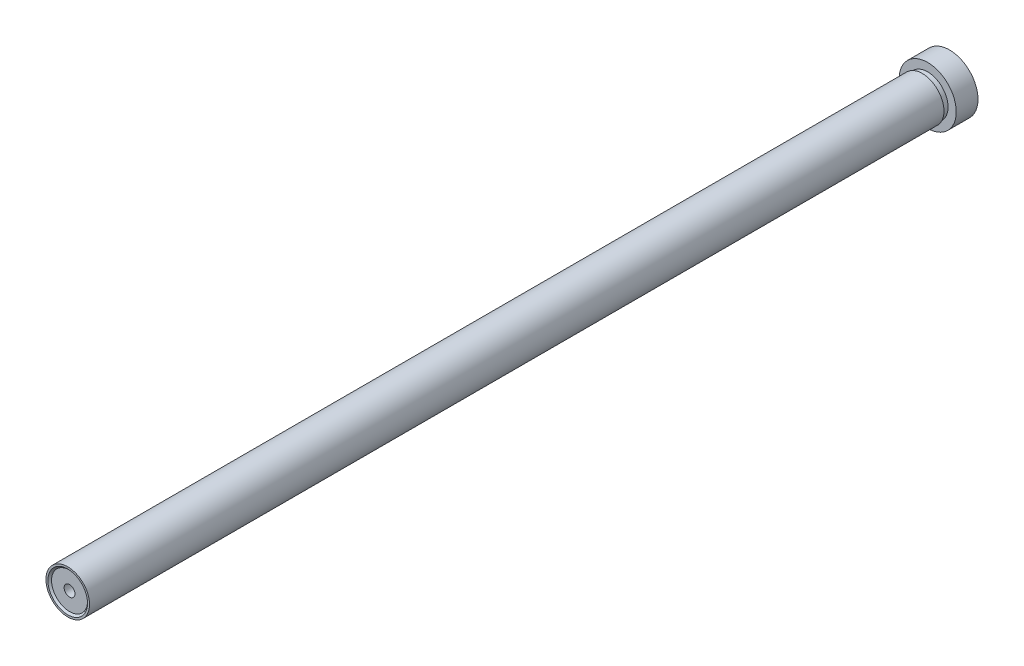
ISO-10303-21;
HEADER;
FILE_DESCRIPTION(('STEP AP214'),'2;1');
FILE_NAME('part.step','',(''),(''),'','','');
FILE_SCHEMA(('AUTOMOTIVE_DESIGN { 1 0 10303 214 1 1 1 1 }'));
ENDSEC;
DATA;
#1=APPLICATION_CONTEXT('core data for automotive mechanical design processes');
#2=APPLICATION_PROTOCOL_DEFINITION('international standard','automotive_design',2000,#1);
#3=PRODUCT_CONTEXT('',#1,'mechanical');
#4=PRODUCT('Part','Part','',(#3));
#5=PRODUCT_RELATED_PRODUCT_CATEGORY('part','',(#4));
#6=PRODUCT_DEFINITION_FORMATION('','',#4);
#7=PRODUCT_DEFINITION_CONTEXT('part definition',#1,'design');
#8=PRODUCT_DEFINITION('design','',#6,#7);
#9=PRODUCT_DEFINITION_SHAPE('','',#8);
#10=(LENGTH_UNIT() NAMED_UNIT(*) SI_UNIT(.MILLI.,.METRE.));
#11=(NAMED_UNIT(*) PLANE_ANGLE_UNIT() SI_UNIT($,.RADIAN.));
#12=(NAMED_UNIT(*) SI_UNIT($,.STERADIAN.) SOLID_ANGLE_UNIT());
#13=UNCERTAINTY_MEASURE_WITH_UNIT(LENGTH_MEASURE(1.E-05),#10,'distance_accuracy_value','');
#14=(GEOMETRIC_REPRESENTATION_CONTEXT(3) GLOBAL_UNCERTAINTY_ASSIGNED_CONTEXT((#13)) GLOBAL_UNIT_ASSIGNED_CONTEXT((#10,
#11,#12)) REPRESENTATION_CONTEXT('',''));
#15=CARTESIAN_POINT('',(0.,0.,0.));
#16=DIRECTION('',(0.,0.,1.));
#17=DIRECTION('',(1.,0.,0.));
#18=AXIS2_PLACEMENT_3D('',#15,#16,#17);
#19=CARTESIAN_POINT('',(0.,0.,8.));
#20=DIRECTION('',(0.,0.,-1.));
#21=DIRECTION('',(-1.,0.,0.));
#22=AXIS2_PLACEMENT_3D('',#19,#20,#21);
#23=CYLINDRICAL_SURFACE('',#22,10.5);
#24=CARTESIAN_POINT('',(0.,0.,8.));
#25=DIRECTION('',(0.,0.,1.));
#26=DIRECTION('',(1.,0.,0.));
#27=AXIS2_PLACEMENT_3D('',#24,#25,#26);
#28=CIRCLE('',#27,10.5);
#29=CARTESIAN_POINT('',(10.5,0.,8.));
#30=VERTEX_POINT('',#29);
#31=EDGE_CURVE('E57',#30,#30,#28,.T.);
#32=ORIENTED_EDGE('',*,*,#31,.F.);
#33=EDGE_LOOP('',(#32));
#34=FACE_BOUND('',#33,.T.);
#35=CARTESIAN_POINT('',(0.,0.,0.));
#36=DIRECTION('',(0.,0.,1.));
#37=DIRECTION('',(1.,0.,0.));
#38=AXIS2_PLACEMENT_3D('',#35,#36,#37);
#39=CIRCLE('',#38,10.5);
#40=CARTESIAN_POINT('',(10.5,0.,0.));
#41=VERTEX_POINT('',#40);
#42=EDGE_CURVE('E52',#41,#41,#39,.T.);
#43=ORIENTED_EDGE('',*,*,#42,.T.);
#44=EDGE_LOOP('',(#43));
#45=FACE_BOUND('',#44,.T.);
#46=ADVANCED_FACE('F49',(#34,#45),#23,.T.);
#47=CARTESIAN_POINT('',(0.,0.,8.));
#48=DIRECTION('',(0.,0.,1.));
#49=DIRECTION('',(1.,0.,0.));
#50=AXIS2_PLACEMENT_3D('',#47,#48,#49);
#51=PLANE('',#50);
#52=CARTESIAN_POINT('',(0.,0.,8.));
#53=DIRECTION('',(0.,0.,1.));
#54=DIRECTION('',(1.,0.,0.));
#55=AXIS2_PLACEMENT_3D('',#52,#53,#54);
#56=CIRCLE('',#55,7.5);
#57=CARTESIAN_POINT('',(7.5,0.,8.));
#58=VERTEX_POINT('',#57);
#59=EDGE_CURVE('E13',#58,#58,#56,.T.);
#60=ORIENTED_EDGE('',*,*,#59,.F.);
#61=EDGE_LOOP('',(#60));
#62=FACE_BOUND('',#61,.T.);
#63=ORIENTED_EDGE('',*,*,#31,.T.);
#64=EDGE_LOOP('',(#63));
#65=FACE_BOUND('',#64,.T.);
#66=ADVANCED_FACE('F120',(#62,#65),#51,.T.);
#67=CARTESIAN_POINT('',(0.,0.,0.));
#68=DIRECTION('',(0.,0.,1.));
#69=DIRECTION('',(1.,0.,0.));
#70=AXIS2_PLACEMENT_3D('',#67,#68,#69);
#71=PLANE('',#70);
#72=CARTESIAN_POINT('',(0.,0.,0.));
#73=DIRECTION('',(0.,0.,-1.));
#74=DIRECTION('',(-1.,0.,0.));
#75=AXIS2_PLACEMENT_3D('',#72,#73,#74);
#76=CIRCLE('',#75,8.1);
#77=CARTESIAN_POINT('',(-8.1,0.,0.));
#78=VERTEX_POINT('',#77);
#79=EDGE_CURVE('E91',#78,#78,#76,.T.);
#80=ORIENTED_EDGE('',*,*,#79,.F.);
#81=EDGE_LOOP('',(#80));
#82=FACE_BOUND('',#81,.T.);
#83=ORIENTED_EDGE('',*,*,#42,.F.);
#84=EDGE_LOOP('',(#83));
#85=FACE_BOUND('',#84,.T.);
#86=ADVANCED_FACE('F117',(#82,#85),#71,.F.);
#87=CARTESIAN_POINT('',(0.,0.,10.));
#88=DIRECTION('',(0.,0.,-1.));
#89=DIRECTION('',(-1.,0.,0.));
#90=AXIS2_PLACEMENT_3D('',#87,#88,#89);
#91=CYLINDRICAL_SURFACE('',#90,7.5);
#92=CARTESIAN_POINT('',(0.,0.,10.));
#93=DIRECTION('',(0.,0.,1.));
#94=DIRECTION('',(1.,0.,0.));
#95=AXIS2_PLACEMENT_3D('',#92,#93,#94);
#96=CIRCLE('',#95,7.5);
#97=CARTESIAN_POINT('',(7.5,0.,10.));
#98=VERTEX_POINT('',#97);
#99=EDGE_CURVE('E106',#98,#98,#96,.T.);
#100=ORIENTED_EDGE('',*,*,#99,.F.);
#101=EDGE_LOOP('',(#100));
#102=FACE_BOUND('',#101,.T.);
#103=ORIENTED_EDGE('',*,*,#59,.T.);
#104=EDGE_LOOP('',(#103));
#105=FACE_BOUND('',#104,.T.);
#106=ADVANCED_FACE('F119',(#102,#105),#91,.T.);
#107=CARTESIAN_POINT('',(0.,0.,324.));
#108=DIRECTION('',(0.,0.,-1.));
#109=DIRECTION('',(-1.,0.,0.));
#110=AXIS2_PLACEMENT_3D('',#107,#108,#109);
#111=CYLINDRICAL_SURFACE('',#110,8.);
#112=CARTESIAN_POINT('',(0.,0.,324.));
#113=DIRECTION('',(0.,0.,1.));
#114=DIRECTION('',(1.,0.,0.));
#115=AXIS2_PLACEMENT_3D('',#112,#113,#114);
#116=CIRCLE('',#115,8.);
#117=CARTESIAN_POINT('',(8.,0.,324.));
#118=VERTEX_POINT('',#117);
#119=EDGE_CURVE('E103',#118,#118,#116,.T.);
#120=ORIENTED_EDGE('',*,*,#119,.F.);
#121=EDGE_LOOP('',(#120));
#122=FACE_BOUND('',#121,.T.);
#123=CARTESIAN_POINT('',(0.,0.,10.));
#124=DIRECTION('',(0.,0.,1.));
#125=DIRECTION('',(1.,0.,0.));
#126=AXIS2_PLACEMENT_3D('',#123,#124,#125);
#127=CIRCLE('',#126,8.);
#128=CARTESIAN_POINT('',(8.,0.,10.));
#129=VERTEX_POINT('',#128);
#130=EDGE_CURVE('E102',#129,#129,#127,.T.);
#131=ORIENTED_EDGE('',*,*,#130,.T.);
#132=EDGE_LOOP('',(#131));
#133=FACE_BOUND('',#132,.T.);
#134=ADVANCED_FACE('F127',(#122,#133),#111,.T.);
#135=CARTESIAN_POINT('',(0.,0.,324.));
#136=DIRECTION('',(0.,0.,1.));
#137=DIRECTION('',(1.,0.,0.));
#138=AXIS2_PLACEMENT_3D('',#135,#136,#137);
#139=PLANE('',#138);
#140=CARTESIAN_POINT('',(0.,0.,324.));
#141=DIRECTION('',(0.,0.,1.));
#142=DIRECTION('',(1.,0.,0.));
#143=AXIS2_PLACEMENT_3D('',#140,#141,#142);
#144=CIRCLE('',#143,7.285);
#145=CARTESIAN_POINT('',(7.285,0.,324.));
#146=VERTEX_POINT('',#145);
#147=EDGE_CURVE('E81',#146,#146,#144,.T.);
#148=ORIENTED_EDGE('',*,*,#147,.F.);
#149=EDGE_LOOP('',(#148));
#150=FACE_BOUND('',#149,.T.);
#151=ORIENTED_EDGE('',*,*,#119,.T.);
#152=EDGE_LOOP('',(#151));
#153=FACE_BOUND('',#152,.T.);
#154=ADVANCED_FACE('F161',(#150,#153),#139,.T.);
#155=CARTESIAN_POINT('',(0.,0.,10.));
#156=DIRECTION('',(0.,0.,1.));
#157=DIRECTION('',(1.,0.,0.));
#158=AXIS2_PLACEMENT_3D('',#155,#156,#157);
#159=PLANE('',#158);
#160=ORIENTED_EDGE('',*,*,#99,.T.);
#161=EDGE_LOOP('',(#160));
#162=FACE_BOUND('',#161,.T.);
#163=ORIENTED_EDGE('',*,*,#130,.F.);
#164=EDGE_LOOP('',(#163));
#165=FACE_BOUND('',#164,.T.);
#166=ADVANCED_FACE('F169',(#162,#165),#159,.F.);
#167=CARTESIAN_POINT('',(0.,0.,1.9));
#168=DIRECTION('',(0.,0.,-1.));
#169=DIRECTION('',(-1.,0.,0.));
#170=AXIS2_PLACEMENT_3D('',#167,#168,#169);
#171=CYLINDRICAL_SURFACE('',#170,8.1);
#172=CARTESIAN_POINT('',(0.,0.,1.9));
#173=DIRECTION('',(0.,0.,-1.));
#174=DIRECTION('',(-1.,0.,0.));
#175=AXIS2_PLACEMENT_3D('',#172,#173,#174);
#176=CIRCLE('',#175,8.1);
#177=CARTESIAN_POINT('',(-8.1,0.,1.9));
#178=VERTEX_POINT('',#177);
#179=EDGE_CURVE('E94',#178,#178,#176,.T.);
#180=CARTESIAN_POINT('',(-8.1,0.,1.9));
#181=CARTESIAN_POINT('',(-8.1,0.,1.88020833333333));
#182=CARTESIAN_POINT('',(-8.1,0.,1.86041666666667));
#183=CARTESIAN_POINT('',(-8.1,0.,1.82083333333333));
#184=CARTESIAN_POINT('',(-8.1,0.,1.80104166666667));
#185=CARTESIAN_POINT('',(-8.1,0.,1.76145833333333));
#186=CARTESIAN_POINT('',(-8.1,0.,1.74166666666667));
#187=CARTESIAN_POINT('',(-8.1,0.,1.70208333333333));
#188=CARTESIAN_POINT('',(-8.1,0.,1.68229166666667));
#189=CARTESIAN_POINT('',(-8.1,0.,1.64270833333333));
#190=CARTESIAN_POINT('',(-8.1,0.,1.62291666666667));
#191=CARTESIAN_POINT('',(-8.1,0.,1.58333333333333));
#192=CARTESIAN_POINT('',(-8.1,0.,1.56354166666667));
#193=CARTESIAN_POINT('',(-8.1,0.,1.52395833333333));
#194=CARTESIAN_POINT('',(-8.1,0.,1.50416666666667));
#195=CARTESIAN_POINT('',(-8.1,0.,1.46458333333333));
#196=CARTESIAN_POINT('',(-8.1,0.,1.44479166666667));
#197=CARTESIAN_POINT('',(-8.1,0.,1.40520833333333));
#198=CARTESIAN_POINT('',(-8.1,0.,1.38541666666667));
#199=CARTESIAN_POINT('',(-8.1,0.,1.34583333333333));
#200=CARTESIAN_POINT('',(-8.1,0.,1.32604166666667));
#201=CARTESIAN_POINT('',(-8.1,0.,1.28645833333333));
#202=CARTESIAN_POINT('',(-8.1,0.,1.26666666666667));
#203=CARTESIAN_POINT('',(-8.1,0.,1.22708333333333));
#204=CARTESIAN_POINT('',(-8.1,0.,1.20729166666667));
#205=CARTESIAN_POINT('',(-8.1,0.,1.16770833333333));
#206=CARTESIAN_POINT('',(-8.1,0.,1.14791666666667));
#207=CARTESIAN_POINT('',(-8.1,0.,1.10833333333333));
#208=CARTESIAN_POINT('',(-8.1,0.,1.08854166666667));
#209=CARTESIAN_POINT('',(-8.1,0.,1.04895833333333));
#210=CARTESIAN_POINT('',(-8.1,0.,1.02916666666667));
#211=CARTESIAN_POINT('',(-8.1,0.,0.989583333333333));
#212=CARTESIAN_POINT('',(-8.1,0.,0.969791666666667));
#213=CARTESIAN_POINT('',(-8.1,0.,0.930208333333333));
#214=CARTESIAN_POINT('',(-8.1,0.,0.910416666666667));
#215=CARTESIAN_POINT('',(-8.1,0.,0.870833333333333));
#216=CARTESIAN_POINT('',(-8.1,0.,0.851041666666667));
#217=CARTESIAN_POINT('',(-8.1,0.,0.811458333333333));
#218=CARTESIAN_POINT('',(-8.1,0.,0.791666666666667));
#219=CARTESIAN_POINT('',(-8.1,0.,0.752083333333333));
#220=CARTESIAN_POINT('',(-8.1,0.,0.732291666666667));
#221=CARTESIAN_POINT('',(-8.1,0.,0.692708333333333));
#222=CARTESIAN_POINT('',(-8.1,0.,0.672916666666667));
#223=CARTESIAN_POINT('',(-8.1,0.,0.633333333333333));
#224=CARTESIAN_POINT('',(-8.1,0.,0.613541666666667));
#225=CARTESIAN_POINT('',(-8.1,0.,0.573958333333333));
#226=CARTESIAN_POINT('',(-8.1,0.,0.554166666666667));
#227=CARTESIAN_POINT('',(-8.1,0.,0.514583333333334));
#228=CARTESIAN_POINT('',(-8.1,0.,0.494791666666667));
#229=CARTESIAN_POINT('',(-8.1,0.,0.455208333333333));
#230=CARTESIAN_POINT('',(-8.1,0.,0.435416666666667));
#231=CARTESIAN_POINT('',(-8.1,0.,0.395833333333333));
#232=CARTESIAN_POINT('',(-8.1,0.,0.376041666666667));
#233=CARTESIAN_POINT('',(-8.1,0.,0.336458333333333));
#234=CARTESIAN_POINT('',(-8.1,0.,0.316666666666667));
#235=CARTESIAN_POINT('',(-8.1,0.,0.277083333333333));
#236=CARTESIAN_POINT('',(-8.1,0.,0.257291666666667));
#237=CARTESIAN_POINT('',(-8.1,0.,0.217708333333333));
#238=CARTESIAN_POINT('',(-8.1,0.,0.197916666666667));
#239=CARTESIAN_POINT('',(-8.1,0.,0.158333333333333));
#240=CARTESIAN_POINT('',(-8.1,0.,0.138541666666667));
#241=CARTESIAN_POINT('',(-8.1,0.,0.0989583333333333));
#242=CARTESIAN_POINT('',(-8.1,0.,0.0791666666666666));
#243=CARTESIAN_POINT('',(-8.1,0.,0.0395833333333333));
#244=CARTESIAN_POINT('',(-8.1,0.,0.0197916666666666));
#245=CARTESIAN_POINT('',(-8.1,0.,0.));
#246=B_SPLINE_CURVE_WITH_KNOTS('',3,(#180,#181,#182,#183,#184,#185,#186,#187,#188,#189,#190,
#191,#192,#193,#194,#195,#196,#197,#198,#199,#200,#201,#202,#203,#204,#205,#206,#207,#208,#209,
#210,#211,#212,#213,#214,#215,#216,#217,#218,#219,#220,#221,#222,#223,#224,#225,#226,#227,#228,
#229,#230,#231,#232,#233,#234,#235,#236,#237,#238,#239,#240,#241,#242,#243,#244,#245),
.UNSPECIFIED.,.F.,.F.,(4,2,2,2,2,2,2,2,2,2,2,2,2,2,2,2,2,2,2,2,2,2,2,2,2,2,2,2,2,2,2,2,4),(0.,
0.059375,0.11875,0.178125,0.2375,0.296875,0.35625,0.415625,0.475,0.534375,0.59375,0.653125,
0.7125,0.771875,0.83125,0.890625,0.95,1.009375,1.06875,1.128125,1.1875,1.246875,1.30625,
1.365625,1.425,1.484375,1.54375,1.603125,1.6625,1.721875,1.78125,1.840625,1.9),.UNSPECIFIED.);
#247=EDGE_CURVE('BSEAM174',#178,#78,#246,.T.);
#248=ORIENTED_EDGE('',*,*,#179,.F.);
#249=ORIENTED_EDGE('',*,*,#79,.T.);
#250=ORIENTED_EDGE('',*,*,#247,.T.);
#251=ORIENTED_EDGE('',*,*,#247,.F.);
#252=EDGE_LOOP('',(#248,#250,#249,#251));
#253=FACE_BOUND('',#252,.T.);
#254=ADVANCED_FACE('F174',(#253),#171,.F.);
#255=CARTESIAN_POINT('',(0.,0.,1.9));
#256=DIRECTION('',(0.,0.,-1.));
#257=DIRECTION('',(-1.,0.,0.));
#258=AXIS2_PLACEMENT_3D('',#255,#256,#257);
#259=PLANE('',#258);
#260=CARTESIAN_POINT('',(0.,0.,1.9));
#261=DIRECTION('',(0.,0.,-1.));
#262=DIRECTION('',(-1.,0.,0.));
#263=AXIS2_PLACEMENT_3D('',#260,#261,#262);
#264=CIRCLE('',#263,5.1);
#265=CARTESIAN_POINT('',(-5.1,0.,1.9));
#266=VERTEX_POINT('',#265);
#267=EDGE_CURVE('E88',#266,#266,#264,.T.);
#268=ORIENTED_EDGE('',*,*,#267,.F.);
#269=EDGE_LOOP('',(#268));
#270=FACE_BOUND('',#269,.T.);
#271=ORIENTED_EDGE('',*,*,#179,.T.);
#272=EDGE_LOOP('',(#271));
#273=FACE_BOUND('',#272,.T.);
#274=ADVANCED_FACE('F198',(#270,#273),#259,.T.);
#275=CARTESIAN_POINT('',(0.,0.,1.9));
#276=DIRECTION('',(0.,0.,-1.));
#277=DIRECTION('',(-1.,0.,0.));
#278=AXIS2_PLACEMENT_3D('',#275,#276,#277);
#279=CYLINDRICAL_SURFACE('',#278,5.1);
#280=CARTESIAN_POINT('',(0.,0.,0.));
#281=DIRECTION('',(0.,0.,-1.));
#282=DIRECTION('',(-1.,0.,0.));
#283=AXIS2_PLACEMENT_3D('',#280,#281,#282);
#284=CIRCLE('',#283,5.1);
#285=CARTESIAN_POINT('',(-5.1,0.,0.));
#286=VERTEX_POINT('',#285);
#287=EDGE_CURVE('E87',#286,#286,#284,.T.);
#288=CARTESIAN_POINT('',(-5.1,0.,1.9));
#289=CARTESIAN_POINT('',(-5.1,0.,1.88020833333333));
#290=CARTESIAN_POINT('',(-5.1,0.,1.86041666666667));
#291=CARTESIAN_POINT('',(-5.1,0.,1.82083333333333));
#292=CARTESIAN_POINT('',(-5.1,0.,1.80104166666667));
#293=CARTESIAN_POINT('',(-5.1,0.,1.76145833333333));
#294=CARTESIAN_POINT('',(-5.1,0.,1.74166666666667));
#295=CARTESIAN_POINT('',(-5.1,0.,1.70208333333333));
#296=CARTESIAN_POINT('',(-5.1,0.,1.68229166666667));
#297=CARTESIAN_POINT('',(-5.1,0.,1.64270833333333));
#298=CARTESIAN_POINT('',(-5.1,0.,1.62291666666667));
#299=CARTESIAN_POINT('',(-5.1,0.,1.58333333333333));
#300=CARTESIAN_POINT('',(-5.1,0.,1.56354166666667));
#301=CARTESIAN_POINT('',(-5.1,0.,1.52395833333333));
#302=CARTESIAN_POINT('',(-5.1,0.,1.50416666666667));
#303=CARTESIAN_POINT('',(-5.1,0.,1.46458333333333));
#304=CARTESIAN_POINT('',(-5.1,0.,1.44479166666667));
#305=CARTESIAN_POINT('',(-5.1,0.,1.40520833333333));
#306=CARTESIAN_POINT('',(-5.1,0.,1.38541666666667));
#307=CARTESIAN_POINT('',(-5.1,0.,1.34583333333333));
#308=CARTESIAN_POINT('',(-5.1,0.,1.32604166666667));
#309=CARTESIAN_POINT('',(-5.1,0.,1.28645833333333));
#310=CARTESIAN_POINT('',(-5.1,0.,1.26666666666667));
#311=CARTESIAN_POINT('',(-5.1,0.,1.22708333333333));
#312=CARTESIAN_POINT('',(-5.1,0.,1.20729166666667));
#313=CARTESIAN_POINT('',(-5.1,0.,1.16770833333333));
#314=CARTESIAN_POINT('',(-5.1,0.,1.14791666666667));
#315=CARTESIAN_POINT('',(-5.1,0.,1.10833333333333));
#316=CARTESIAN_POINT('',(-5.1,0.,1.08854166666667));
#317=CARTESIAN_POINT('',(-5.1,0.,1.04895833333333));
#318=CARTESIAN_POINT('',(-5.1,0.,1.02916666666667));
#319=CARTESIAN_POINT('',(-5.1,0.,0.989583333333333));
#320=CARTESIAN_POINT('',(-5.1,0.,0.969791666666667));
#321=CARTESIAN_POINT('',(-5.1,0.,0.930208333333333));
#322=CARTESIAN_POINT('',(-5.1,0.,0.910416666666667));
#323=CARTESIAN_POINT('',(-5.1,0.,0.870833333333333));
#324=CARTESIAN_POINT('',(-5.1,0.,0.851041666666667));
#325=CARTESIAN_POINT('',(-5.1,0.,0.811458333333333));
#326=CARTESIAN_POINT('',(-5.1,0.,0.791666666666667));
#327=CARTESIAN_POINT('',(-5.1,0.,0.752083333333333));
#328=CARTESIAN_POINT('',(-5.1,0.,0.732291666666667));
#329=CARTESIAN_POINT('',(-5.1,0.,0.692708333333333));
#330=CARTESIAN_POINT('',(-5.1,0.,0.672916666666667));
#331=CARTESIAN_POINT('',(-5.1,0.,0.633333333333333));
#332=CARTESIAN_POINT('',(-5.1,0.,0.613541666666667));
#333=CARTESIAN_POINT('',(-5.1,0.,0.573958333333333));
#334=CARTESIAN_POINT('',(-5.1,0.,0.554166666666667));
#335=CARTESIAN_POINT('',(-5.1,0.,0.514583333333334));
#336=CARTESIAN_POINT('',(-5.1,0.,0.494791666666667));
#337=CARTESIAN_POINT('',(-5.1,0.,0.455208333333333));
#338=CARTESIAN_POINT('',(-5.1,0.,0.435416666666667));
#339=CARTESIAN_POINT('',(-5.1,0.,0.395833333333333));
#340=CARTESIAN_POINT('',(-5.1,0.,0.376041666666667));
#341=CARTESIAN_POINT('',(-5.1,0.,0.336458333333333));
#342=CARTESIAN_POINT('',(-5.1,0.,0.316666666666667));
#343=CARTESIAN_POINT('',(-5.1,0.,0.277083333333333));
#344=CARTESIAN_POINT('',(-5.1,0.,0.257291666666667));
#345=CARTESIAN_POINT('',(-5.1,0.,0.217708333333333));
#346=CARTESIAN_POINT('',(-5.1,0.,0.197916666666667));
#347=CARTESIAN_POINT('',(-5.1,0.,0.158333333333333));
#348=CARTESIAN_POINT('',(-5.1,0.,0.138541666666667));
#349=CARTESIAN_POINT('',(-5.1,0.,0.0989583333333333));
#350=CARTESIAN_POINT('',(-5.1,0.,0.0791666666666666));
#351=CARTESIAN_POINT('',(-5.1,0.,0.0395833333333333));
#352=CARTESIAN_POINT('',(-5.1,0.,0.0197916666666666));
#353=CARTESIAN_POINT('',(-5.1,0.,0.));
#354=B_SPLINE_CURVE_WITH_KNOTS('',3,(#288,#289,#290,#291,#292,#293,#294,#295,#296,#297,#298,
#299,#300,#301,#302,#303,#304,#305,#306,#307,#308,#309,#310,#311,#312,#313,#314,#315,#316,#317,
#318,#319,#320,#321,#322,#323,#324,#325,#326,#327,#328,#329,#330,#331,#332,#333,#334,#335,#336,
#337,#338,#339,#340,#341,#342,#343,#344,#345,#346,#347,#348,#349,#350,#351,#352,#353),
.UNSPECIFIED.,.F.,.F.,(4,2,2,2,2,2,2,2,2,2,2,2,2,2,2,2,2,2,2,2,2,2,2,2,2,2,2,2,2,2,2,2,4),(0.,
0.059375,0.11875,0.178125,0.2375,0.296875,0.35625,0.415625,0.475,0.534375,0.59375,0.653125,
0.7125,0.771875,0.83125,0.890625,0.95,1.009375,1.06875,1.128125,1.1875,1.246875,1.30625,
1.365625,1.425,1.484375,1.54375,1.603125,1.6625,1.721875,1.78125,1.840625,1.9),.UNSPECIFIED.);
#355=EDGE_CURVE('BSEAM184',#266,#286,#354,.T.);
#356=ORIENTED_EDGE('',*,*,#267,.T.);
#357=ORIENTED_EDGE('',*,*,#287,.F.);
#358=ORIENTED_EDGE('',*,*,#355,.T.);
#359=ORIENTED_EDGE('',*,*,#355,.F.);
#360=EDGE_LOOP('',(#356,#358,#357,#359));
#361=FACE_BOUND('',#360,.T.);
#362=ADVANCED_FACE('F184',(#361),#279,.T.);
#363=CARTESIAN_POINT('',(0.,0.,313.));
#364=DIRECTION('',(0.,0.,-1.));
#365=DIRECTION('',(-1.,0.,0.));
#366=AXIS2_PLACEMENT_3D('',#363,#364,#365);
#367=CYLINDRICAL_SURFACE('',#366,2.75);
#368=CARTESIAN_POINT('',(0.,0.,313.));
#369=DIRECTION('',(0.,0.,-1.));
#370=DIRECTION('',(-1.,0.,0.));
#371=AXIS2_PLACEMENT_3D('',#368,#369,#370);
#372=CIRCLE('',#371,2.75);
#373=CARTESIAN_POINT('',(-2.75,0.,313.));
#374=VERTEX_POINT('',#373);
#375=EDGE_CURVE('E71',#374,#374,#372,.T.);
#376=ORIENTED_EDGE('',*,*,#375,.F.);
#377=EDGE_LOOP('',(#376));
#378=FACE_BOUND('',#377,.T.);
#379=CARTESIAN_POINT('',(0.,0.,0.));
#380=DIRECTION('',(0.,0.,-1.));
#381=DIRECTION('',(-1.,0.,0.));
#382=AXIS2_PLACEMENT_3D('',#379,#380,#381);
#383=CIRCLE('',#382,2.75);
#384=CARTESIAN_POINT('',(-2.75,0.,0.));
#385=VERTEX_POINT('',#384);
#386=EDGE_CURVE('E97',#385,#385,#383,.T.);
#387=ORIENTED_EDGE('',*,*,#386,.T.);
#388=EDGE_LOOP('',(#387));
#389=FACE_BOUND('',#388,.T.);
#390=ADVANCED_FACE('F135',(#378,#389),#367,.F.);
#391=ORIENTED_EDGE('',*,*,#386,.F.);
#392=EDGE_LOOP('',(#391));
#393=FACE_BOUND('',#392,.T.);
#394=ORIENTED_EDGE('',*,*,#287,.T.);
#395=EDGE_LOOP('',(#394));
#396=FACE_BOUND('',#395,.T.);
#397=ADVANCED_FACE('F122',(#393,#396),#71,.F.);
#398=CARTESIAN_POINT('',(0.,0.,324.));
#399=DIRECTION('',(0.,0.,1.));
#400=DIRECTION('',(1.,0.,0.));
#401=AXIS2_PLACEMENT_3D('',#398,#399,#400);
#402=CONICAL_SURFACE('',#401,7.285,0.78539816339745);
#403=CARTESIAN_POINT('',(0.,0.,323.33));
#404=DIRECTION('',(0.,0.,1.));
#405=DIRECTION('',(1.,0.,0.));
#406=AXIS2_PLACEMENT_3D('',#403,#404,#405);
#407=CIRCLE('',#406,6.61499999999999);
#408=CARTESIAN_POINT('',(6.61499999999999,0.,323.33));
#409=VERTEX_POINT('',#408);
#410=EDGE_CURVE('E84',#409,#409,#407,.T.);
#411=ORIENTED_EDGE('',*,*,#410,.F.);
#412=EDGE_LOOP('',(#411));
#413=FACE_BOUND('',#412,.T.);
#414=ORIENTED_EDGE('',*,*,#147,.T.);
#415=EDGE_LOOP('',(#414));
#416=FACE_BOUND('',#415,.T.);
#417=ADVANCED_FACE('F134',(#413,#416),#402,.F.);
#418=CARTESIAN_POINT('',(0.,0.,323.33));
#419=DIRECTION('',(0.,0.,1.));
#420=DIRECTION('',(1.,0.,0.));
#421=AXIS2_PLACEMENT_3D('',#418,#419,#420);
#422=PLANE('',#421);
#423=CARTESIAN_POINT('',(0.,0.,323.33));
#424=DIRECTION('',(0.,0.,1.));
#425=DIRECTION('',(1.,0.,0.));
#426=AXIS2_PLACEMENT_3D('',#423,#424,#425);
#427=CIRCLE('',#426,2.);
#428=CARTESIAN_POINT('',(2.,0.,323.33));
#429=VERTEX_POINT('',#428);
#430=EDGE_CURVE('E76',#429,#429,#427,.T.);
#431=ORIENTED_EDGE('',*,*,#430,.F.);
#432=EDGE_LOOP('',(#431));
#433=FACE_BOUND('',#432,.T.);
#434=ORIENTED_EDGE('',*,*,#410,.T.);
#435=EDGE_LOOP('',(#434));
#436=FACE_BOUND('',#435,.T.);
#437=ADVANCED_FACE('F237',(#433,#436),#422,.T.);
#438=CARTESIAN_POINT('',(0.,0.,320.33));
#439=DIRECTION('',(0.,0.,1.));
#440=DIRECTION('',(1.,0.,0.));
#441=AXIS2_PLACEMENT_3D('',#438,#439,#440);
#442=CYLINDRICAL_SURFACE('',#441,2.);
#443=CARTESIAN_POINT('',(0.,0.,320.33));
#444=DIRECTION('',(0.,0.,1.));
#445=DIRECTION('',(1.,0.,0.));
#446=AXIS2_PLACEMENT_3D('',#443,#444,#445);
#447=CIRCLE('',#446,2.);
#448=CARTESIAN_POINT('',(2.,0.,320.33));
#449=VERTEX_POINT('',#448);
#450=EDGE_CURVE('E73',#449,#449,#447,.T.);
#451=ORIENTED_EDGE('',*,*,#450,.F.);
#452=EDGE_LOOP('',(#451));
#453=FACE_BOUND('',#452,.T.);
#454=ORIENTED_EDGE('',*,*,#430,.T.);
#455=EDGE_LOOP('',(#454));
#456=FACE_BOUND('',#455,.T.);
#457=ADVANCED_FACE('F247',(#453,#456),#442,.F.);
#458=CARTESIAN_POINT('',(0.,0.,320.33));
#459=DIRECTION('',(0.,0.,1.));
#460=DIRECTION('',(1.,0.,0.));
#461=AXIS2_PLACEMENT_3D('',#458,#459,#460);
#462=CONICAL_SURFACE('',#461,2.,1.0471975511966);
#463=CARTESIAN_POINT('',(0.,0.,319.175299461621));
#464=VERTEX_POINT('',#463);
#465=VERTEX_LOOP('',#464);
#466=FACE_BOUND('',#465,.T.);
#467=ORIENTED_EDGE('',*,*,#450,.T.);
#468=EDGE_LOOP('',(#467));
#469=FACE_BOUND('',#468,.T.);
#470=ADVANCED_FACE('F67',(#466,#469),#462,.F.);
#471=CARTESIAN_POINT('',(0.,0.,313.));
#472=DIRECTION('',(0.,0.,-1.));
#473=DIRECTION('',(-1.,0.,0.));
#474=AXIS2_PLACEMENT_3D('',#471,#472,#473);
#475=CONICAL_SURFACE('',#474,2.75,1.0471975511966);
#476=CARTESIAN_POINT('',(0.,0.,314.587713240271));
#477=VERTEX_POINT('',#476);
#478=VERTEX_LOOP('',#477);
#479=FACE_BOUND('',#478,.T.);
#480=ORIENTED_EDGE('',*,*,#375,.T.);
#481=EDGE_LOOP('',(#480));
#482=FACE_BOUND('',#481,.T.);
#483=ADVANCED_FACE('F64',(#479,#482),#475,.F.);
#484=CLOSED_SHELL('',(#46,#66,#86,#106,#134,#154,#166,#254,#274,#362,#390,#397,#417,#437,#457,
#470,#483));
#485=MANIFOLD_SOLID_BREP('B2',#484);
#486=ADVANCED_BREP_SHAPE_REPRESENTATION('',(#18,#485),#14);
#487=SHAPE_DEFINITION_REPRESENTATION(#9,#486);
ENDSEC;
END-ISO-10303-21;
